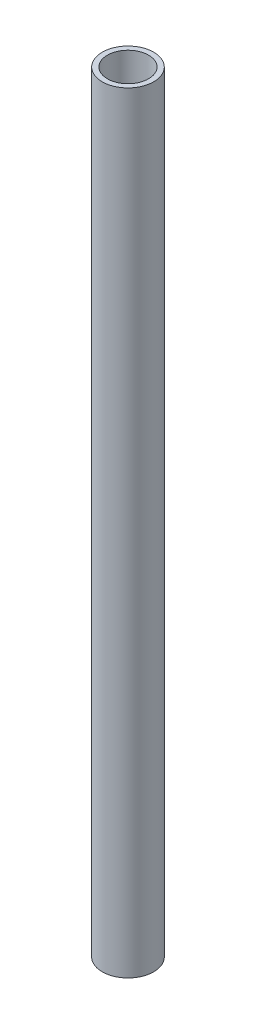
from build123d import *

# Parameters (mm, degrees)
SKETCH1_R           = 5
SKETCH1_R_2         = 4
BOSS_EXTRUDE1_DEPTH = 150


with BuildPart() as part:
    # Sketch1 → Boss-Extrude1 (new body)
    with BuildSketch(Plane(origin=(0, 0, 0), x_dir=(1, 0, 0), z_dir=(0, 1, 0))):
        with Locations(Location((0, 0, 0), (0, 0, 270))):
            Circle(SKETCH1_R)
        with Locations(Location((0, 0, 0), (0, 0, 270))):
            Circle(SKETCH1_R_2, mode=Mode.SUBTRACT)
    extrude(amount=BOSS_EXTRUDE1_DEPTH)


solid = part.part
